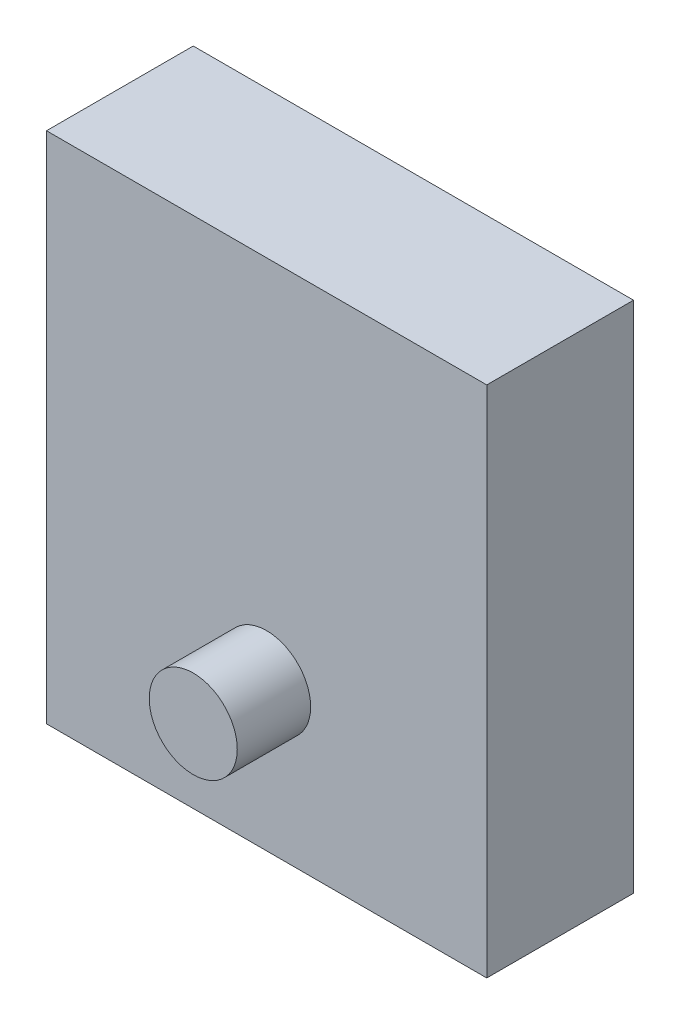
ISO-10303-21;
HEADER;
FILE_DESCRIPTION(('STEP AP214'),'2;1');
FILE_NAME('part.step','',(''),(''),'','','');
FILE_SCHEMA(('AUTOMOTIVE_DESIGN { 1 0 10303 214 1 1 1 1 }'));
ENDSEC;
DATA;
#1=APPLICATION_CONTEXT('core data for automotive mechanical design processes');
#2=APPLICATION_PROTOCOL_DEFINITION('international standard','automotive_design',2000,#1);
#3=PRODUCT_CONTEXT('',#1,'mechanical');
#4=PRODUCT('Part','Part','',(#3));
#5=PRODUCT_RELATED_PRODUCT_CATEGORY('part','',(#4));
#6=PRODUCT_DEFINITION_FORMATION('','',#4);
#7=PRODUCT_DEFINITION_CONTEXT('part definition',#1,'design');
#8=PRODUCT_DEFINITION('design','',#6,#7);
#9=PRODUCT_DEFINITION_SHAPE('','',#8);
#10=(LENGTH_UNIT() NAMED_UNIT(*) SI_UNIT(.MILLI.,.METRE.));
#11=(NAMED_UNIT(*) PLANE_ANGLE_UNIT() SI_UNIT($,.RADIAN.));
#12=(NAMED_UNIT(*) SI_UNIT($,.STERADIAN.) SOLID_ANGLE_UNIT());
#13=UNCERTAINTY_MEASURE_WITH_UNIT(LENGTH_MEASURE(1.E-05),#10,'distance_accuracy_value','');
#14=(GEOMETRIC_REPRESENTATION_CONTEXT(3) GLOBAL_UNCERTAINTY_ASSIGNED_CONTEXT((#13)) GLOBAL_UNIT_ASSIGNED_CONTEXT((#10,
#11,#12)) REPRESENTATION_CONTEXT('',''));
#15=CARTESIAN_POINT('',(0.,0.,0.));
#16=DIRECTION('',(0.,0.,1.));
#17=DIRECTION('',(1.,0.,0.));
#18=AXIS2_PLACEMENT_3D('',#15,#16,#17);
#19=CARTESIAN_POINT('',(0.,0.,5.));
#20=DIRECTION('',(0.,0.,-1.));
#21=DIRECTION('',(-1.,0.,0.));
#22=AXIS2_PLACEMENT_3D('',#19,#20,#21);
#23=CYLINDRICAL_SURFACE('',#22,3.);
#24=CARTESIAN_POINT('',(0.,0.,5.));
#25=DIRECTION('',(0.,0.,1.));
#26=DIRECTION('',(1.,0.,0.));
#27=AXIS2_PLACEMENT_3D('',#24,#25,#26);
#28=CIRCLE('',#27,3.);
#29=CARTESIAN_POINT('',(3.,0.,5.));
#30=VERTEX_POINT('',#29);
#31=EDGE_CURVE('E11',#30,#30,#28,.T.);
#32=ORIENTED_EDGE('',*,*,#31,.F.);
#33=EDGE_LOOP('',(#32));
#34=FACE_BOUND('',#33,.T.);
#35=CARTESIAN_POINT('',(0.,0.,0.));
#36=DIRECTION('',(0.,0.,1.));
#37=DIRECTION('',(1.,0.,0.));
#38=AXIS2_PLACEMENT_3D('',#35,#36,#37);
#39=CIRCLE('',#38,3.);
#40=CARTESIAN_POINT('',(3.,0.,0.));
#41=VERTEX_POINT('',#40);
#42=EDGE_CURVE('E43',#41,#41,#39,.T.);
#43=ORIENTED_EDGE('',*,*,#42,.T.);
#44=EDGE_LOOP('',(#43));
#45=FACE_BOUND('',#44,.T.);
#46=ADVANCED_FACE('F40',(#34,#45),#23,.T.);
#47=CARTESIAN_POINT('',(0.,-28.4970345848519,5.));
#48=DIRECTION('',(0.,0.,1.));
#49=DIRECTION('',(1.,0.,0.));
#50=AXIS2_PLACEMENT_3D('',#47,#48,#49);
#51=PLANE('',#50);
#52=ORIENTED_EDGE('',*,*,#31,.T.);
#53=EDGE_LOOP('',(#52));
#54=FACE_BOUND('',#53,.T.);
#55=ADVANCED_FACE('F55',(#54),#51,.T.);
#56=CARTESIAN_POINT('',(0.,-28.4970345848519,0.));
#57=DIRECTION('',(0.,0.,1.));
#58=DIRECTION('',(1.,0.,0.));
#59=AXIS2_PLACEMENT_3D('',#56,#57,#58);
#60=PLANE('',#59);
#61=ORIENTED_EDGE('',*,*,#42,.F.);
#62=EDGE_LOOP('',(#61));
#63=FACE_BOUND('',#62,.T.);
#64=ADVANCED_FACE('F53',(#63),#60,.F.);
#65=CLOSED_SHELL('',(#46,#55,#64));
#66=MANIFOLD_SOLID_BREP('B2',#65);
#67=CARTESIAN_POINT('',(15.,-28.4970345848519,-10.));
#68=DIRECTION('',(-1.,0.,0.));
#69=DIRECTION('',(0.,-1.,0.));
#70=AXIS2_PLACEMENT_3D('',#67,#68,#69);
#71=PLANE('',#70);
#72=DIRECTION('',(0.,-1.,0.));
#73=VECTOR('',#72,1.);
#74=CARTESIAN_POINT('',(15.,-28.4970345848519,0.));
#75=LINE('',#74,#73);
#76=CARTESIAN_POINT('',(15.,25.,0.));
#77=VERTEX_POINT('',#76);
#78=CARTESIAN_POINT('',(15.,-9.99999999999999,0.));
#79=VERTEX_POINT('',#78);
#80=EDGE_CURVE('E146',#77,#79,#75,.T.);
#81=ORIENTED_EDGE('',*,*,#80,.T.);
#82=DIRECTION('',(0.,0.,1.));
#83=VECTOR('',#82,1.);
#84=CARTESIAN_POINT('',(15.,-9.99999999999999,-10.));
#85=LINE('',#84,#83);
#86=CARTESIAN_POINT('',(15.,-9.99999999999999,-10.));
#87=VERTEX_POINT('',#86);
#88=EDGE_CURVE('E38',#87,#79,#85,.T.);
#89=ORIENTED_EDGE('',*,*,#88,.F.);
#90=DIRECTION('',(0.,-1.,0.));
#91=VECTOR('',#90,1.);
#92=CARTESIAN_POINT('',(15.,-28.4970345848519,-10.));
#93=LINE('',#92,#91);
#94=CARTESIAN_POINT('',(15.,25.,-10.));
#95=VERTEX_POINT('',#94);
#96=EDGE_CURVE('E99',#95,#87,#93,.T.);
#97=ORIENTED_EDGE('',*,*,#96,.F.);
#98=DIRECTION('',(0.,0.,1.));
#99=VECTOR('',#98,1.);
#100=CARTESIAN_POINT('',(15.,25.,-10.));
#101=LINE('',#100,#99);
#102=EDGE_CURVE('E84',#95,#77,#101,.T.);
#103=ORIENTED_EDGE('',*,*,#102,.T.);
#104=EDGE_LOOP('',(#81,#89,#97,#103));
#105=FACE_BOUND('',#104,.T.);
#106=ADVANCED_FACE('F80',(#105),#71,.F.);
#107=CARTESIAN_POINT('',(0.,-9.99999999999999,-10.));
#108=DIRECTION('',(0.,-1.,0.));
#109=DIRECTION('',(0.,0.,-1.));
#110=AXIS2_PLACEMENT_3D('',#107,#108,#109);
#111=PLANE('',#110);
#112=DIRECTION('',(1.,0.,0.));
#113=VECTOR('',#112,1.);
#114=CARTESIAN_POINT('',(0.,-9.99999999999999,0.));
#115=LINE('',#114,#113);
#116=CARTESIAN_POINT('',(-15.,-9.99999999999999,0.));
#117=VERTEX_POINT('',#116);
#118=EDGE_CURVE('E151',#117,#79,#115,.T.);
#119=ORIENTED_EDGE('',*,*,#118,.F.);
#120=DIRECTION('',(0.,0.,1.));
#121=VECTOR('',#120,1.);
#122=CARTESIAN_POINT('',(-15.,-9.99999999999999,-10.));
#123=LINE('',#122,#121);
#124=CARTESIAN_POINT('',(-15.,-9.99999999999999,-10.));
#125=VERTEX_POINT('',#124);
#126=EDGE_CURVE('E90',#125,#117,#123,.T.);
#127=ORIENTED_EDGE('',*,*,#126,.F.);
#128=DIRECTION('',(1.,0.,0.));
#129=VECTOR('',#128,1.);
#130=CARTESIAN_POINT('',(0.,-9.99999999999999,-10.));
#131=LINE('',#130,#129);
#132=EDGE_CURVE('E138',#125,#87,#131,.T.);
#133=ORIENTED_EDGE('',*,*,#132,.T.);
#134=ORIENTED_EDGE('',*,*,#88,.T.);
#135=EDGE_LOOP('',(#119,#127,#133,#134));
#136=FACE_BOUND('',#135,.T.);
#137=ADVANCED_FACE('F170',(#136),#111,.T.);
#138=CARTESIAN_POINT('',(-15.,-28.4970345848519,-10.));
#139=DIRECTION('',(-1.,0.,0.));
#140=DIRECTION('',(0.,-1.,0.));
#141=AXIS2_PLACEMENT_3D('',#138,#139,#140);
#142=PLANE('',#141);
#143=DIRECTION('',(0.,-1.,0.));
#144=VECTOR('',#143,1.);
#145=CARTESIAN_POINT('',(-15.,-28.4970345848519,0.));
#146=LINE('',#145,#144);
#147=CARTESIAN_POINT('',(-15.,25.,0.));
#148=VERTEX_POINT('',#147);
#149=EDGE_CURVE('E131',#148,#117,#146,.T.);
#150=ORIENTED_EDGE('',*,*,#149,.F.);
#151=DIRECTION('',(0.,0.,1.));
#152=VECTOR('',#151,1.);
#153=CARTESIAN_POINT('',(-15.,25.,-10.));
#154=LINE('',#153,#152);
#155=CARTESIAN_POINT('',(-15.,25.,-10.));
#156=VERTEX_POINT('',#155);
#157=EDGE_CURVE('E128',#156,#148,#154,.T.);
#158=ORIENTED_EDGE('',*,*,#157,.F.);
#159=DIRECTION('',(0.,-1.,0.));
#160=VECTOR('',#159,1.);
#161=CARTESIAN_POINT('',(-15.,-28.4970345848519,-10.));
#162=LINE('',#161,#160);
#163=EDGE_CURVE('E130',#156,#125,#162,.T.);
#164=ORIENTED_EDGE('',*,*,#163,.T.);
#165=ORIENTED_EDGE('',*,*,#126,.T.);
#166=EDGE_LOOP('',(#150,#158,#164,#165));
#167=FACE_BOUND('',#166,.T.);
#168=ADVANCED_FACE('F129',(#167),#142,.T.);
#169=CARTESIAN_POINT('',(0.,0.,-10.));
#170=DIRECTION('',(0.,0.,1.));
#171=DIRECTION('',(1.,0.,0.));
#172=AXIS2_PLACEMENT_3D('',#169,#170,#171);
#173=CYLINDRICAL_SURFACE('',#172,3.);
#174=CARTESIAN_POINT('',(0.,0.,-10.));
#175=DIRECTION('',(0.,0.,1.));
#176=DIRECTION('',(1.,0.,0.));
#177=AXIS2_PLACEMENT_3D('',#174,#175,#176);
#178=CIRCLE('',#177,3.);
#179=CARTESIAN_POINT('',(3.,0.,-10.));
#180=VERTEX_POINT('',#179);
#181=EDGE_CURVE('E153',#180,#180,#178,.T.);
#182=ORIENTED_EDGE('',*,*,#181,.F.);
#183=EDGE_LOOP('',(#182));
#184=FACE_BOUND('',#183,.T.);
#185=CARTESIAN_POINT('',(0.,0.,0.));
#186=DIRECTION('',(0.,0.,1.));
#187=DIRECTION('',(1.,0.,0.));
#188=AXIS2_PLACEMENT_3D('',#185,#186,#187);
#189=CIRCLE('',#188,3.);
#190=CARTESIAN_POINT('',(3.,0.,0.));
#191=VERTEX_POINT('',#190);
#192=EDGE_CURVE('E143',#191,#191,#189,.T.);
#193=ORIENTED_EDGE('',*,*,#192,.T.);
#194=EDGE_LOOP('',(#193));
#195=FACE_BOUND('',#194,.T.);
#196=ADVANCED_FACE('F82',(#184,#195),#173,.F.);
#197=CARTESIAN_POINT('',(0.,25.,-10.));
#198=DIRECTION('',(0.,-1.,0.));
#199=DIRECTION('',(0.,0.,-1.));
#200=AXIS2_PLACEMENT_3D('',#197,#198,#199);
#201=PLANE('',#200);
#202=DIRECTION('',(1.,0.,0.));
#203=VECTOR('',#202,1.);
#204=CARTESIAN_POINT('',(0.,25.,0.));
#205=LINE('',#204,#203);
#206=EDGE_CURVE('E148',#148,#77,#205,.T.);
#207=ORIENTED_EDGE('',*,*,#206,.T.);
#208=ORIENTED_EDGE('',*,*,#102,.F.);
#209=DIRECTION('',(1.,0.,0.));
#210=VECTOR('',#209,1.);
#211=CARTESIAN_POINT('',(0.,25.,-10.));
#212=LINE('',#211,#210);
#213=EDGE_CURVE('E125',#156,#95,#212,.T.);
#214=ORIENTED_EDGE('',*,*,#213,.F.);
#215=ORIENTED_EDGE('',*,*,#157,.T.);
#216=EDGE_LOOP('',(#207,#208,#214,#215));
#217=FACE_BOUND('',#216,.T.);
#218=ADVANCED_FACE('F134',(#217),#201,.F.);
#219=CARTESIAN_POINT('',(0.,-28.4970345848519,-10.));
#220=DIRECTION('',(0.,0.,1.));
#221=DIRECTION('',(1.,0.,0.));
#222=AXIS2_PLACEMENT_3D('',#219,#220,#221);
#223=PLANE('',#222);
#224=ORIENTED_EDGE('',*,*,#181,.T.);
#225=EDGE_LOOP('',(#224));
#226=FACE_BOUND('',#225,.T.);
#227=ORIENTED_EDGE('',*,*,#96,.T.);
#228=ORIENTED_EDGE('',*,*,#132,.F.);
#229=ORIENTED_EDGE('',*,*,#163,.F.);
#230=ORIENTED_EDGE('',*,*,#213,.T.);
#231=EDGE_LOOP('',(#227,#228,#229,#230));
#232=FACE_BOUND('',#231,.T.);
#233=ADVANCED_FACE('F137',(#226,#232),#223,.F.);
#234=CARTESIAN_POINT('',(0.,-28.4970345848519,0.));
#235=DIRECTION('',(0.,0.,1.));
#236=DIRECTION('',(1.,0.,0.));
#237=AXIS2_PLACEMENT_3D('',#234,#235,#236);
#238=PLANE('',#237);
#239=ORIENTED_EDGE('',*,*,#192,.F.);
#240=EDGE_LOOP('',(#239));
#241=FACE_BOUND('',#240,.T.);
#242=ORIENTED_EDGE('',*,*,#80,.F.);
#243=ORIENTED_EDGE('',*,*,#206,.F.);
#244=ORIENTED_EDGE('',*,*,#149,.T.);
#245=ORIENTED_EDGE('',*,*,#118,.T.);
#246=EDGE_LOOP('',(#242,#243,#244,#245));
#247=FACE_BOUND('',#246,.T.);
#248=ADVANCED_FACE('F166',(#241,#247),#238,.T.);
#249=CLOSED_SHELL('',(#106,#137,#168,#196,#218,#233,#248));
#250=MANIFOLD_SOLID_BREP('B6',#249);
#251=ADVANCED_BREP_SHAPE_REPRESENTATION('',(#18,#66,#250),#14);
#252=SHAPE_DEFINITION_REPRESENTATION(#9,#251);
ENDSEC;
END-ISO-10303-21;
